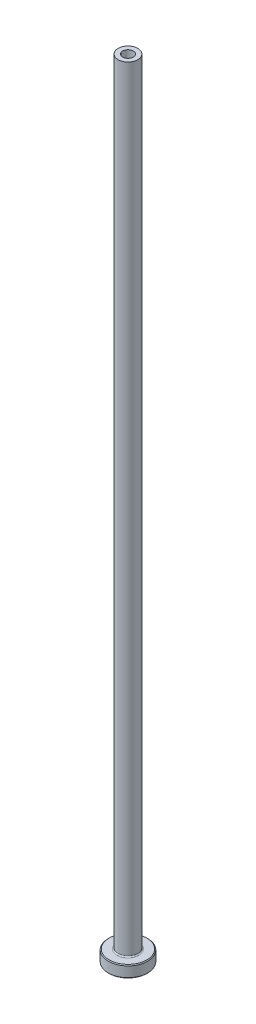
ISO-10303-21;
HEADER;
FILE_DESCRIPTION(('STEP AP214'),'2;1');
FILE_NAME('part.step','',(''),(''),'','','');
FILE_SCHEMA(('AUTOMOTIVE_DESIGN { 1 0 10303 214 1 1 1 1 }'));
ENDSEC;
DATA;
#1=APPLICATION_CONTEXT('core data for automotive mechanical design processes');
#2=APPLICATION_PROTOCOL_DEFINITION('international standard','automotive_design',2000,#1);
#3=PRODUCT_CONTEXT('',#1,'mechanical');
#4=PRODUCT('Part','Part','',(#3));
#5=PRODUCT_RELATED_PRODUCT_CATEGORY('part','',(#4));
#6=PRODUCT_DEFINITION_FORMATION('','',#4);
#7=PRODUCT_DEFINITION_CONTEXT('part definition',#1,'design');
#8=PRODUCT_DEFINITION('design','',#6,#7);
#9=PRODUCT_DEFINITION_SHAPE('','',#8);
#10=(LENGTH_UNIT() NAMED_UNIT(*) SI_UNIT(.MILLI.,.METRE.));
#11=(NAMED_UNIT(*) PLANE_ANGLE_UNIT() SI_UNIT($,.RADIAN.));
#12=(NAMED_UNIT(*) SI_UNIT($,.STERADIAN.) SOLID_ANGLE_UNIT());
#13=UNCERTAINTY_MEASURE_WITH_UNIT(LENGTH_MEASURE(1.E-05),#10,'distance_accuracy_value','');
#14=(GEOMETRIC_REPRESENTATION_CONTEXT(3) GLOBAL_UNCERTAINTY_ASSIGNED_CONTEXT((#13)) GLOBAL_UNIT_ASSIGNED_CONTEXT((#10,
#11,#12)) REPRESENTATION_CONTEXT('',''));
#15=CARTESIAN_POINT('',(0.,0.,0.));
#16=DIRECTION('',(0.,0.,1.));
#17=DIRECTION('',(1.,0.,0.));
#18=AXIS2_PLACEMENT_3D('',#15,#16,#17);
#19=CARTESIAN_POINT('',(0.,92.1876809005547,0.));
#20=DIRECTION('',(0.,1.,0.));
#21=DIRECTION('',(0.,0.,1.));
#22=AXIS2_PLACEMENT_3D('',#19,#20,#21);
#23=CYLINDRICAL_SURFACE('',#22,1.35);
#24=CARTESIAN_POINT('',(0.,200.,0.));
#25=DIRECTION('',(0.,1.,0.));
#26=DIRECTION('',(0.,0.,1.));
#27=AXIS2_PLACEMENT_3D('',#24,#25,#26);
#28=CIRCLE('',#27,1.35);
#29=CARTESIAN_POINT('',(0.,200.,1.35));
#30=VERTEX_POINT('',#29);
#31=EDGE_CURVE('E62',#30,#30,#28,.T.);
#32=ORIENTED_EDGE('',*,*,#31,.T.);
#33=EDGE_LOOP('',(#32));
#34=FACE_BOUND('',#33,.T.);
#35=CARTESIAN_POINT('',(0.,155.,0.));
#36=DIRECTION('',(0.,1.,0.));
#37=DIRECTION('',(0.,0.,1.));
#38=AXIS2_PLACEMENT_3D('',#35,#36,#37);
#39=CIRCLE('',#38,1.35);
#40=CARTESIAN_POINT('',(0.,155.,1.35));
#41=VERTEX_POINT('',#40);
#42=EDGE_CURVE('E71',#41,#41,#39,.T.);
#43=ORIENTED_EDGE('',*,*,#42,.F.);
#44=EDGE_LOOP('',(#43));
#45=FACE_BOUND('',#44,.T.);
#46=ADVANCED_FACE('F30',(#34,#45),#23,.F.);
#47=CARTESIAN_POINT('',(-1.35,200.,0.));
#48=DIRECTION('',(0.,1.,0.));
#49=DIRECTION('',(0.,0.,1.));
#50=AXIS2_PLACEMENT_3D('',#47,#48,#49);
#51=PLANE('',#50);
#52=CARTESIAN_POINT('',(0.,200.,0.));
#53=DIRECTION('',(0.,1.,0.));
#54=DIRECTION('',(0.,0.,1.));
#55=AXIS2_PLACEMENT_3D('',#52,#53,#54);
#56=CIRCLE('',#55,2.50000000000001);
#57=CARTESIAN_POINT('',(0.,200.,2.50000000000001));
#58=VERTEX_POINT('',#57);
#59=EDGE_CURVE('E65',#58,#58,#56,.T.);
#60=ORIENTED_EDGE('',*,*,#59,.T.);
#61=EDGE_LOOP('',(#60));
#62=FACE_BOUND('',#61,.T.);
#63=ORIENTED_EDGE('',*,*,#31,.F.);
#64=EDGE_LOOP('',(#63));
#65=FACE_BOUND('',#64,.T.);
#66=ADVANCED_FACE('F79',(#62,#65),#51,.T.);
#67=CARTESIAN_POINT('',(0.,92.1876809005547,0.));
#68=DIRECTION('',(0.,1.,0.));
#69=DIRECTION('',(0.,0.,1.));
#70=AXIS2_PLACEMENT_3D('',#67,#68,#69);
#71=CYLINDRICAL_SURFACE('',#70,2.5);
#72=CARTESIAN_POINT('',(0.,3.3,0.));
#73=DIRECTION('',(0.,1.,0.));
#74=DIRECTION('',(0.,0.,1.));
#75=AXIS2_PLACEMENT_3D('',#72,#73,#74);
#76=CIRCLE('',#75,2.5);
#77=CARTESIAN_POINT('',(0.,3.3,2.5));
#78=VERTEX_POINT('',#77);
#79=EDGE_CURVE('E59',#78,#78,#76,.T.);
#80=ORIENTED_EDGE('',*,*,#79,.T.);
#81=EDGE_LOOP('',(#80));
#82=FACE_BOUND('',#81,.T.);
#83=ORIENTED_EDGE('',*,*,#59,.F.);
#84=EDGE_LOOP('',(#83));
#85=FACE_BOUND('',#84,.T.);
#86=ADVANCED_FACE('F85',(#82,#85),#71,.T.);
#87=CARTESIAN_POINT('',(-2.49999999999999,3.,0.));
#88=DIRECTION('',(0.,1.,0.));
#89=DIRECTION('',(0.,0.,1.));
#90=AXIS2_PLACEMENT_3D('',#87,#88,#89);
#91=PLANE('',#90);
#92=CARTESIAN_POINT('',(0.,3.,0.));
#93=DIRECTION('',(0.,1.,0.));
#94=DIRECTION('',(0.,0.,1.));
#95=AXIS2_PLACEMENT_3D('',#92,#93,#94);
#96=CIRCLE('',#95,4.79999999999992);
#97=CARTESIAN_POINT('',(0.,3.,4.79999999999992));
#98=VERTEX_POINT('',#97);
#99=EDGE_CURVE('E53',#98,#98,#96,.T.);
#100=ORIENTED_EDGE('',*,*,#99,.T.);
#101=EDGE_LOOP('',(#100));
#102=FACE_BOUND('',#101,.T.);
#103=CARTESIAN_POINT('',(0.,3.,0.));
#104=DIRECTION('',(0.,1.,0.));
#105=DIRECTION('',(0.,0.,1.));
#106=AXIS2_PLACEMENT_3D('',#103,#104,#105);
#107=CIRCLE('',#106,2.8);
#108=CARTESIAN_POINT('',(0.,3.,2.8));
#109=VERTEX_POINT('',#108);
#110=EDGE_CURVE('E56',#109,#109,#107,.F.);
#111=ORIENTED_EDGE('',*,*,#110,.T.);
#112=EDGE_LOOP('',(#111));
#113=FACE_BOUND('',#112,.T.);
#114=ADVANCED_FACE('F111',(#102,#113),#91,.T.);
#115=CARTESIAN_POINT('',(0.,92.1876809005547,0.));
#116=DIRECTION('',(0.,1.,0.));
#117=DIRECTION('',(0.,0.,1.));
#118=AXIS2_PLACEMENT_3D('',#115,#116,#117);
#119=CYLINDRICAL_SURFACE('',#118,4.99999999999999);
#120=CARTESIAN_POINT('',(0.,2.79999999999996,0.));
#121=DIRECTION('',(0.,1.,0.));
#122=DIRECTION('',(0.,0.,1.));
#123=AXIS2_PLACEMENT_3D('',#120,#121,#122);
#124=CIRCLE('',#123,4.99999999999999);
#125=CARTESIAN_POINT('',(0.,2.79999999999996,4.99999999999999));
#126=VERTEX_POINT('',#125);
#127=EDGE_CURVE('E45',#126,#126,#124,.F.);
#128=ORIENTED_EDGE('',*,*,#127,.T.);
#129=EDGE_LOOP('',(#128));
#130=FACE_BOUND('',#129,.T.);
#131=CARTESIAN_POINT('',(0.,0.199999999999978,0.));
#132=DIRECTION('',(0.,-1.,0.));
#133=DIRECTION('',(0.,0.,-1.));
#134=AXIS2_PLACEMENT_3D('',#131,#132,#133);
#135=CIRCLE('',#134,4.99999999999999);
#136=CARTESIAN_POINT('',(0.,0.199999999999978,4.99999999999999));
#137=VERTEX_POINT('',#136);
#138=EDGE_CURVE('E50',#137,#137,#135,.F.);
#139=ORIENTED_EDGE('',*,*,#138,.T.);
#140=EDGE_LOOP('',(#139));
#141=FACE_BOUND('',#140,.T.);
#142=ADVANCED_FACE('F108',(#130,#141),#119,.T.);
#143=CARTESIAN_POINT('',(-4.99999999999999,0.,0.));
#144=DIRECTION('',(0.,-1.,0.));
#145=DIRECTION('',(0.,0.,-1.));
#146=AXIS2_PLACEMENT_3D('',#143,#144,#145);
#147=PLANE('',#146);
#148=CARTESIAN_POINT('',(0.,0.,0.));
#149=DIRECTION('',(0.,-1.,0.));
#150=DIRECTION('',(0.,0.,-1.));
#151=AXIS2_PLACEMENT_3D('',#148,#149,#150);
#152=CIRCLE('',#151,2.10000000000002);
#153=CARTESIAN_POINT('',(0.,0.,-2.10000000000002));
#154=VERTEX_POINT('',#153);
#155=EDGE_CURVE('E37',#154,#154,#152,.F.);
#156=ORIENTED_EDGE('',*,*,#155,.T.);
#157=EDGE_LOOP('',(#156));
#158=FACE_BOUND('',#157,.T.);
#159=CARTESIAN_POINT('',(0.,0.,0.));
#160=DIRECTION('',(0.,-1.,0.));
#161=DIRECTION('',(0.,0.,-1.));
#162=AXIS2_PLACEMENT_3D('',#159,#160,#161);
#163=CIRCLE('',#162,4.80000000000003);
#164=CARTESIAN_POINT('',(0.,0.,4.80000000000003));
#165=VERTEX_POINT('',#164);
#166=EDGE_CURVE('E41',#165,#165,#163,.T.);
#167=ORIENTED_EDGE('',*,*,#166,.T.);
#168=EDGE_LOOP('',(#167));
#169=FACE_BOUND('',#168,.T.);
#170=ADVANCED_FACE('F110',(#158,#169),#147,.T.);
#171=CARTESIAN_POINT('',(0.,92.1876809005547,0.));
#172=DIRECTION('',(0.,1.,0.));
#173=DIRECTION('',(0.,0.,1.));
#174=AXIS2_PLACEMENT_3D('',#171,#172,#173);
#175=CYLINDRICAL_SURFACE('',#174,1.6);
#176=CARTESIAN_POINT('',(0.,0.499999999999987,0.));
#177=DIRECTION('',(0.,-1.,0.));
#178=DIRECTION('',(0.,0.,-1.));
#179=AXIS2_PLACEMENT_3D('',#176,#177,#178);
#180=CIRCLE('',#179,1.6);
#181=CARTESIAN_POINT('',(0.,0.499999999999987,-1.6));
#182=VERTEX_POINT('',#181);
#183=EDGE_CURVE('E10',#182,#182,#180,.T.);
#184=ORIENTED_EDGE('',*,*,#183,.T.);
#185=EDGE_LOOP('',(#184));
#186=FACE_BOUND('',#185,.T.);
#187=CARTESIAN_POINT('',(0.,143.,0.));
#188=DIRECTION('',(0.,1.,0.));
#189=DIRECTION('',(0.,0.,1.));
#190=AXIS2_PLACEMENT_3D('',#187,#188,#189);
#191=CIRCLE('',#190,1.60000000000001);
#192=CARTESIAN_POINT('',(0.,143.,1.60000000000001));
#193=VERTEX_POINT('',#192);
#194=EDGE_CURVE('E68',#193,#193,#191,.T.);
#195=ORIENTED_EDGE('',*,*,#194,.T.);
#196=EDGE_LOOP('',(#195));
#197=FACE_BOUND('',#196,.T.);
#198=ADVANCED_FACE('F118',(#186,#197),#175,.F.);
#199=CARTESIAN_POINT('',(0.,143.,0.));
#200=DIRECTION('',(0.,-1.,0.));
#201=DIRECTION('',(0.,0.,-1.));
#202=AXIS2_PLACEMENT_3D('',#199,#200,#201);
#203=CONICAL_SURFACE('',#202,1.60000000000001,0.0208303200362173);
#204=ORIENTED_EDGE('',*,*,#42,.T.);
#205=EDGE_LOOP('',(#204));
#206=FACE_BOUND('',#205,.T.);
#207=ORIENTED_EDGE('',*,*,#194,.F.);
#208=EDGE_LOOP('',(#207));
#209=FACE_BOUND('',#208,.T.);
#210=ADVANCED_FACE('F75',(#206,#209),#203,.F.);
#211=CARTESIAN_POINT('',(0.,3.3,0.));
#212=DIRECTION('',(0.,1.,0.));
#213=DIRECTION('',(0.,0.,1.));
#214=AXIS2_PLACEMENT_3D('',#211,#212,#213);
#215=TOROIDAL_SURFACE('',#214,2.8,0.3);
#216=ORIENTED_EDGE('',*,*,#110,.F.);
#217=EDGE_LOOP('',(#216));
#218=FACE_BOUND('',#217,.T.);
#219=ORIENTED_EDGE('',*,*,#79,.F.);
#220=EDGE_LOOP('',(#219));
#221=FACE_BOUND('',#220,.T.);
#222=ADVANCED_FACE('F90',(#218,#221),#215,.F.);
#223=CARTESIAN_POINT('',(0.,3.,0.));
#224=DIRECTION('',(0.,-1.,0.));
#225=DIRECTION('',(0.,0.,-1.));
#226=AXIS2_PLACEMENT_3D('',#223,#224,#225);
#227=CONICAL_SURFACE('',#226,4.79999999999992,0.785398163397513);
#228=ORIENTED_EDGE('',*,*,#127,.F.);
#229=EDGE_LOOP('',(#228));
#230=FACE_BOUND('',#229,.T.);
#231=ORIENTED_EDGE('',*,*,#99,.F.);
#232=EDGE_LOOP('',(#231));
#233=FACE_BOUND('',#232,.T.);
#234=ADVANCED_FACE('F93',(#230,#233),#227,.T.);
#235=CARTESIAN_POINT('',(0.,0.199999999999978,0.));
#236=DIRECTION('',(0.,1.,0.));
#237=DIRECTION('',(0.,0.,1.));
#238=AXIS2_PLACEMENT_3D('',#235,#236,#237);
#239=CONICAL_SURFACE('',#238,4.99999999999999,0.785398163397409);
#240=CARTESIAN_POINT('',(0.,0.,4.80000000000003));
#241=CARTESIAN_POINT('',(0.,0.00208333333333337,4.80208333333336));
#242=CARTESIAN_POINT('',(0.,0.00416666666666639,4.80416666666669));
#243=CARTESIAN_POINT('',(0.,0.00833333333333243,4.80833333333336));
#244=CARTESIAN_POINT('',(0.,0.0104166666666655,4.81041666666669));
#245=CARTESIAN_POINT('',(0.,0.0145833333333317,4.81458333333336));
#246=CARTESIAN_POINT('',(0.,0.0166666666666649,4.81666666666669));
#247=CARTESIAN_POINT('',(0.,0.0208333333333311,4.82083333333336));
#248=CARTESIAN_POINT('',(0.,0.0229166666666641,4.82291666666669));
#249=CARTESIAN_POINT('',(0.,0.0270833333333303,4.82708333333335));
#250=CARTESIAN_POINT('',(0.,0.0291666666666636,4.82916666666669));
#251=CARTESIAN_POINT('',(0.,0.0333333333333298,4.83333333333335));
#252=CARTESIAN_POINT('',(0.,0.0354166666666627,4.83541666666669));
#253=CARTESIAN_POINT('',(0.,0.0395833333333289,4.83958333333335));
#254=CARTESIAN_POINT('',(0.,0.0416666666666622,4.84166666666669));
#255=CARTESIAN_POINT('',(0.,0.0458333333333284,4.84583333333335));
#256=CARTESIAN_POINT('',(0.,0.0479166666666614,4.84791666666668));
#257=CARTESIAN_POINT('',(0.,0.0520833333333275,4.85208333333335));
#258=CARTESIAN_POINT('',(0.,0.0541666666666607,4.85416666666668));
#259=CARTESIAN_POINT('',(0.,0.058333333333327,4.85833333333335));
#260=CARTESIAN_POINT('',(0.,0.0604166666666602,4.86041666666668));
#261=CARTESIAN_POINT('',(0.,0.0645833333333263,4.86458333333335));
#262=CARTESIAN_POINT('',(0.,0.0666666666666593,4.86666666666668));
#263=CARTESIAN_POINT('',(0.,0.0708333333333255,4.87083333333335));
#264=CARTESIAN_POINT('',(0.,0.0729166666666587,4.87291666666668));
#265=CARTESIAN_POINT('',(0.,0.0770833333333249,4.87708333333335));
#266=CARTESIAN_POINT('',(0.,0.0791666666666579,4.87916666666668));
#267=CARTESIAN_POINT('',(0.,0.0833333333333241,4.88333333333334));
#268=CARTESIAN_POINT('',(0.,0.0854166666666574,4.88541666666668));
#269=CARTESIAN_POINT('',(0.,0.0895833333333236,4.88958333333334));
#270=CARTESIAN_POINT('',(0.,0.0916666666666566,4.89166666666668));
#271=CARTESIAN_POINT('',(0.,0.0958333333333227,4.89583333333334));
#272=CARTESIAN_POINT('',(0.,0.0979166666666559,4.89791666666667));
#273=CARTESIAN_POINT('',(0.,0.102083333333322,4.90208333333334));
#274=CARTESIAN_POINT('',(0.,0.104166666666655,4.90416666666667));
#275=CARTESIAN_POINT('',(0.,0.108333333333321,4.90833333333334));
#276=CARTESIAN_POINT('',(0.,0.110416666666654,4.91041666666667));
#277=CARTESIAN_POINT('',(0.,0.114583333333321,4.91458333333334));
#278=CARTESIAN_POINT('',(0.,0.116666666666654,4.91666666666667));
#279=CARTESIAN_POINT('',(0.,0.12083333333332,4.92083333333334));
#280=CARTESIAN_POINT('',(0.,0.122916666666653,4.92291666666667));
#281=CARTESIAN_POINT('',(0.,0.127083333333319,4.92708333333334));
#282=CARTESIAN_POINT('',(0.,0.129166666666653,4.92916666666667));
#283=CARTESIAN_POINT('',(0.,0.133333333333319,4.93333333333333));
#284=CARTESIAN_POINT('',(0.,0.135416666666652,4.93541666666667));
#285=CARTESIAN_POINT('',(0.,0.139583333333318,4.93958333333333));
#286=CARTESIAN_POINT('',(0.,0.141666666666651,4.94166666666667));
#287=CARTESIAN_POINT('',(0.,0.145833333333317,4.94583333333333));
#288=CARTESIAN_POINT('',(0.,0.14791666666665,4.94791666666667));
#289=CARTESIAN_POINT('',(0.,0.152083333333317,4.95208333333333));
#290=CARTESIAN_POINT('',(0.,0.15416666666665,4.95416666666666));
#291=CARTESIAN_POINT('',(0.,0.158333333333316,4.95833333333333));
#292=CARTESIAN_POINT('',(0.,0.160416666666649,4.96041666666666));
#293=CARTESIAN_POINT('',(0.,0.164583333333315,4.96458333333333));
#294=CARTESIAN_POINT('',(0.,0.166666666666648,4.96666666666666));
#295=CARTESIAN_POINT('',(0.,0.170833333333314,4.97083333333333));
#296=CARTESIAN_POINT('',(0.,0.172916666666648,4.97291666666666));
#297=CARTESIAN_POINT('',(0.,0.177083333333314,4.97708333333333));
#298=CARTESIAN_POINT('',(0.,0.179166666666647,4.97916666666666));
#299=CARTESIAN_POINT('',(0.,0.183333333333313,4.98333333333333));
#300=CARTESIAN_POINT('',(0.,0.185416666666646,4.98541666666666));
#301=CARTESIAN_POINT('',(0.,0.189583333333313,4.98958333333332));
#302=CARTESIAN_POINT('',(0.,0.191666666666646,4.99166666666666));
#303=CARTESIAN_POINT('',(0.,0.195833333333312,4.99583333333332));
#304=CARTESIAN_POINT('',(0.,0.197916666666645,4.99791666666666));
#305=CARTESIAN_POINT('',(0.,0.199999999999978,4.99999999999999));
#306=B_SPLINE_CURVE_WITH_KNOTS('',3,(#240,#241,#242,#243,#244,#245,#246,#247,#248,#249,#250,
#251,#252,#253,#254,#255,#256,#257,#258,#259,#260,#261,#262,#263,#264,#265,#266,#267,#268,#269,
#270,#271,#272,#273,#274,#275,#276,#277,#278,#279,#280,#281,#282,#283,#284,#285,#286,#287,#288,
#289,#290,#291,#292,#293,#294,#295,#296,#297,#298,#299,#300,#301,#302,#303,#304,#305),
.UNSPECIFIED.,.F.,.F.,(4,2,2,2,2,2,2,2,2,2,2,2,2,2,2,2,2,2,2,2,2,2,2,2,2,2,2,2,2,2,2,2,4),(0.,
0.00883883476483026,0.0176776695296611,0.0265165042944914,0.0353553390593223,0.0441941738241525,
0.0530330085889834,0.0618718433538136,0.0707106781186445,0.0795495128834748,0.088388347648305,
0.0972271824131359,0.106066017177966,0.114904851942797,0.123743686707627,0.132582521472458,
0.141421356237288,0.150260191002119,0.15909902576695,0.16793786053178,0.176776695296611,
0.185615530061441,0.194454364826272,0.203293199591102,0.212132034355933,0.220970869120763,
0.229809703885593,0.238648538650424,0.247487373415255,0.256326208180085,0.265165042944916,
0.274003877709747,0.282842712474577),.UNSPECIFIED.);
#307=EDGE_CURVE('BSEAM96',#165,#137,#306,.T.);
#308=ORIENTED_EDGE('',*,*,#166,.F.);
#309=ORIENTED_EDGE('',*,*,#138,.F.);
#310=ORIENTED_EDGE('',*,*,#307,.T.);
#311=ORIENTED_EDGE('',*,*,#307,.F.);
#312=EDGE_LOOP('',(#308,#310,#309,#311));
#313=FACE_BOUND('',#312,.T.);
#314=ADVANCED_FACE('F96',(#313),#239,.T.);
#315=CARTESIAN_POINT('',(0.,0.,0.));
#316=DIRECTION('',(0.,-1.,0.));
#317=DIRECTION('',(0.,0.,-1.));
#318=AXIS2_PLACEMENT_3D('',#315,#316,#317);
#319=CONICAL_SURFACE('',#318,2.10000000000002,0.785398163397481);
#320=ORIENTED_EDGE('',*,*,#183,.F.);
#321=EDGE_LOOP('',(#320));
#322=FACE_BOUND('',#321,.T.);
#323=ORIENTED_EDGE('',*,*,#155,.F.);
#324=EDGE_LOOP('',(#323));
#325=FACE_BOUND('',#324,.T.);
#326=ADVANCED_FACE('F32',(#322,#325),#319,.F.);
#327=CLOSED_SHELL('',(#46,#66,#86,#114,#142,#170,#198,#210,#222,#234,#314,#326));
#328=MANIFOLD_SOLID_BREP('B2',#327);
#329=ADVANCED_BREP_SHAPE_REPRESENTATION('',(#18,#328),#14);
#330=SHAPE_DEFINITION_REPRESENTATION(#9,#329);
ENDSEC;
END-ISO-10303-21;
